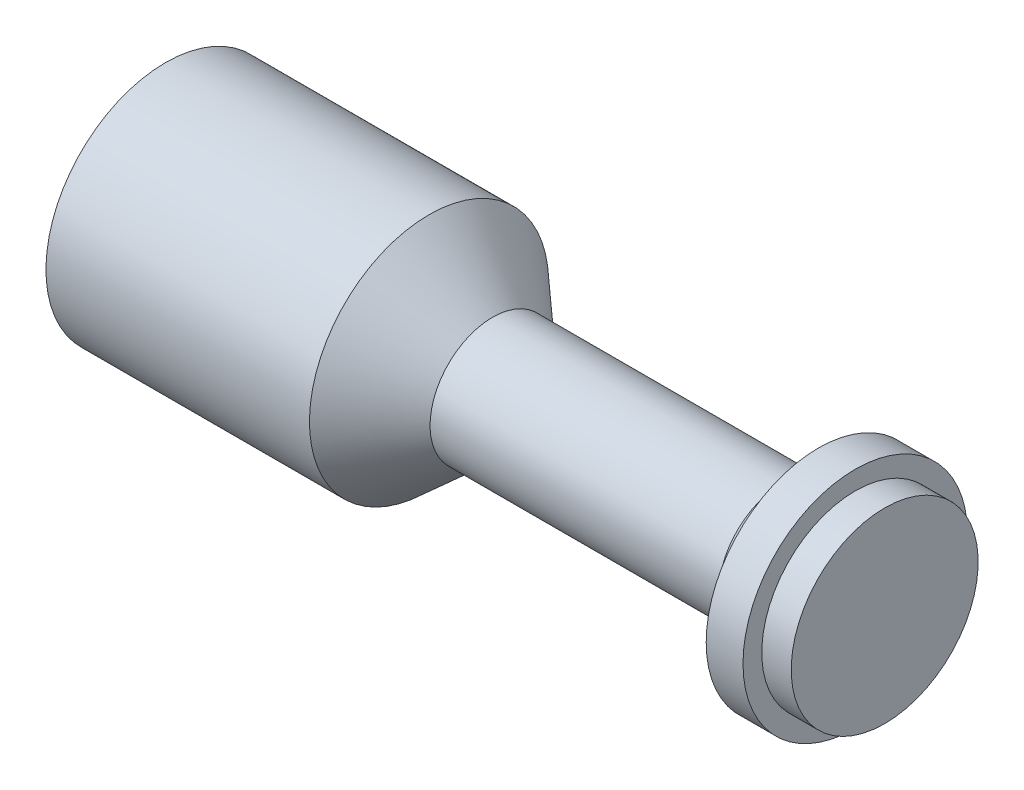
from build123d import *


with BuildPart() as part:
    # Sketch1 → Revolve1 (revolve)
    with BuildSketch(Plane.XY):
        Polygon((-60.015655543, 0), (-60.015655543, 16.25), (-24.215655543, 16.25), (-15.582843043, 8.5), (-8.215655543, 8.5), (-3.733884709, 8.5), (0, 8.5), (23.649142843, 8.5), (26.059685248, 10.910542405), (28.684344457, 10.910542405), (28.684344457, 15.25), (33.684344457, 15.25), (33.684344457, 12.7), (37.684344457, 12.7), (37.684344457, 0), align=None)
    revolve(axis=Axis((37.684344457, 0, 0), (-1, 0, 0)))


solid = part.part
